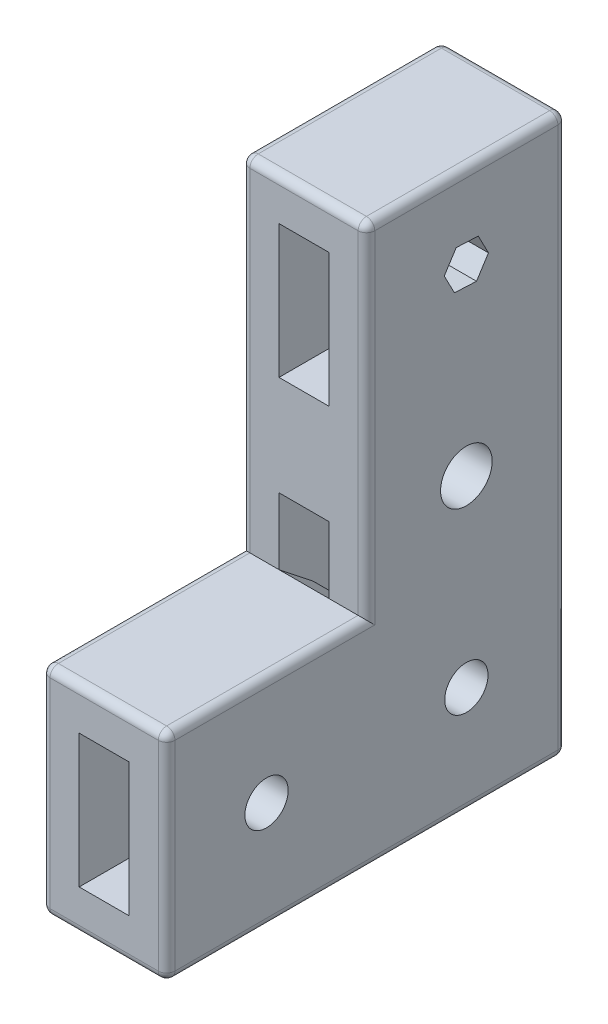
from build123d import *

# Parameters (mm, degrees)
EXTRUDE_1_DEPTH     = 15
SKETCH_2_R          = 2.6
SKETCH_2_R_2        = 3.1
CUT_EXTRUDE_1_DEPTH = 49.233656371
SKETCH_5_W          = 6
SKETCH_5_H          = 16
CUT_EXTRUDE_2_DEPTH = 62.391185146
FILLET_1_R          = 1
FILLET_2_R          = 1


with BuildPart() as part:
    # Sketch 1 → Extrude 1 (new body)
    with BuildSketch(Plane.YZ):
        Polygon((-35.211895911, 29.353159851), (-35.211895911, -18.646840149), (31.788104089, -18.646840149), (31.788104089, 5.353159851), (-9.211895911, 5.353159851), (-9.211895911, 29.353159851), align=None)
    extrude(amount=EXTRUDE_1_DEPTH)

    # Sketch 2 → Cut-Extrude 1 (cut, through all)
    with BuildSketch(Plane.YZ.offset(15)):
        with Locations(Location((-22.211895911, 17.353159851, 0), (0, 0, 270))):
            Circle(SKETCH_2_R)
        with Locations(Location((-22.211895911, -6.646840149, 0), (0, 0, 270))):
            Circle(SKETCH_2_R)
        with Locations(Location((-0.211895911, -6.646840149, 0), (0, 0, 270))):
            Circle(SKETCH_2_R_2)
        Polygon((24.024383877, -8.079455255), (24.146925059, -5.426472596), (21.910645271, -3.993857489), (19.551824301, -5.214225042), (19.429283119, -7.867207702), (21.665562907, -9.299822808), align=None)
    extrude(amount=-CUT_EXTRUDE_1_DEPTH, mode=Mode.SUBTRACT)

    # Sketch 4 → Loft 1 section 0
    with BuildSketch(Plane(origin=(0, 0, -18.646840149), x_dir=(1, 0, 0), z_dir=(0, 0, -1))):
        with BuildLine():
            Line((4.5, 28.211895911), (10.5, 28.211895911))
            Line((10.5, 28.211895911), (10.5, 16.211895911))
            Line((10.5, 16.211895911), (4.5, 16.211895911))
            Line((4.5, 16.211895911), (4.5, 28.211895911))
        make_face()
    # Sketch 3 → Loft 1 section 1
    with BuildSketch(Plane.XY.offset(5.353159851)):
        with BuildLine():
            Line((4.5, -9.211895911), (10.5, -9.211895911))
            Line((10.5, -9.211895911), (10.5, -1.211895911))
            Line((10.5, -1.211895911), (4.5, -1.211895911))
            Line((4.5, -1.211895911), (4.5, -9.211895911))
        make_face()
    loft(mode=Mode.SUBTRACT)

    # Sketch 5 → Cut-Extrude 2 (cut, through all)
    with BuildSketch(Plane(origin=(0, 0, -18.646840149), x_dir=(1, 0, 0), z_dir=(0, 0, -1))):
        with Locations((7.5, 22.211895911)):
            Rectangle(SKETCH_5_W, SKETCH_5_H)
        with Locations((7.5, -18.788104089)):
            Rectangle(SKETCH_5_W, SKETCH_5_H)
    extrude(amount=-CUT_EXTRUDE_2_DEPTH, mode=Mode.SUBTRACT)

    # Fillet 1
    fillet_1_edges = [part.edges().sort_by_distance(p)[0] for p in [
        (7.5, -14.211895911, -0.962629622),
    ]]
    fillet(fillet_1_edges, radius=FILLET_1_R)

    # Fillet 2
    fillet_2_edges = [part.edges().sort_by_distance(p)[0] for p in [
        (0, -1.711895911, -18.646840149),
        (7.5, 31.788104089, -18.646840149),
        (0, 31.788104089, -6.646840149),
        (7.5, 31.788104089, 5.353159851),
        (15, 31.788104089, -6.646840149),
        (15, -1.711895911, -18.646840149),
        (15, 11.288104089, 5.353159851),
        (15, -9.211895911, 17.353159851),
        (0, -9.211895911, 17.353159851),
        (0, 11.288104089, 5.353159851),
        (7.5, -35.211895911, -18.646840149),
        (15, -35.211895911, 5.353159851),
        (0, -35.211895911, 5.353159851),
        (15, -22.211895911, 29.353159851),
        (7.5, -35.211895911, 29.353159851),
        (0, -22.211895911, 29.353159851),
        (7.5, -9.211895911, 29.353159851),
    ]]
    fillet(fillet_2_edges, radius=FILLET_2_R)


solid = part.part
